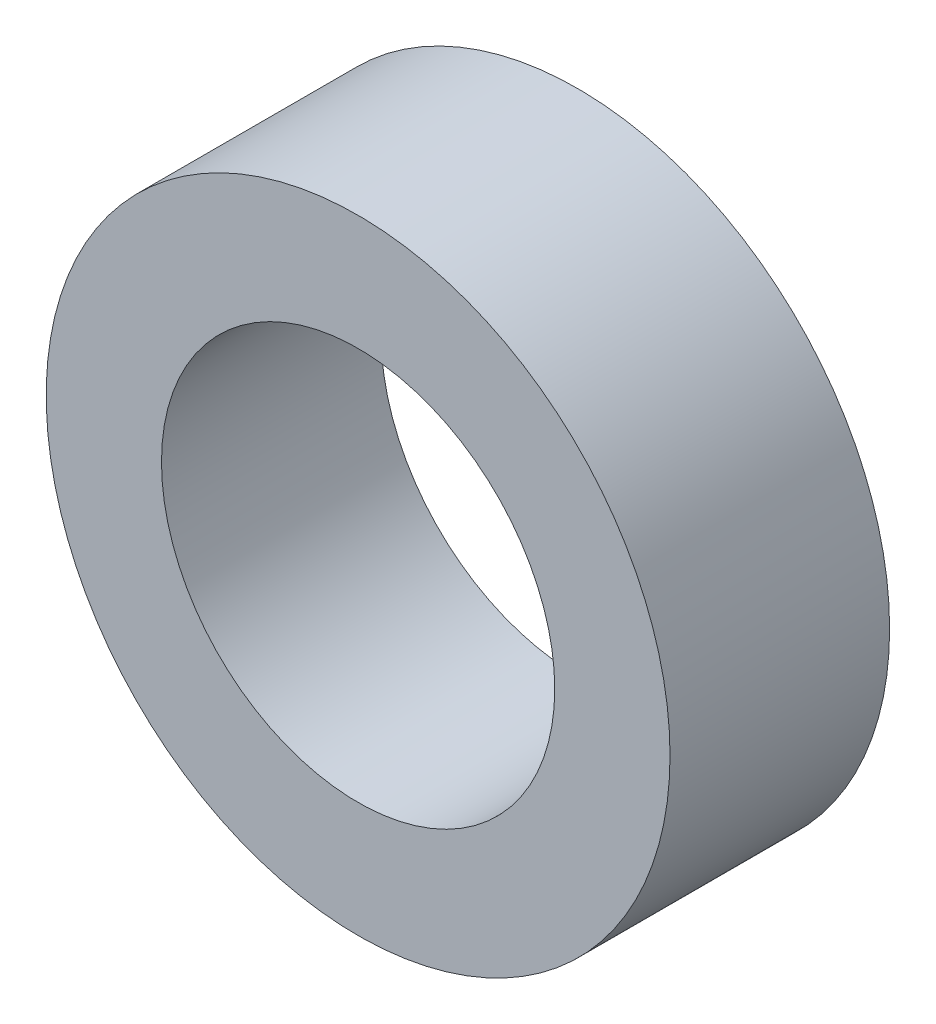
from build123d import *

# Parameters (mm, degrees)
SKETCH1_R           = 7.9375
SKETCH1_R_2         = 5.0038
BOSS_EXTRUDE1_DEPTH = 5.588


with BuildPart() as part:
    # Sketch1 → Boss-Extrude1 (new body)
    with BuildSketch(Plane.XY):
        Circle(SKETCH1_R)
        Circle(SKETCH1_R_2, mode=Mode.SUBTRACT)
    extrude(amount=BOSS_EXTRUDE1_DEPTH)


solid = part.part
